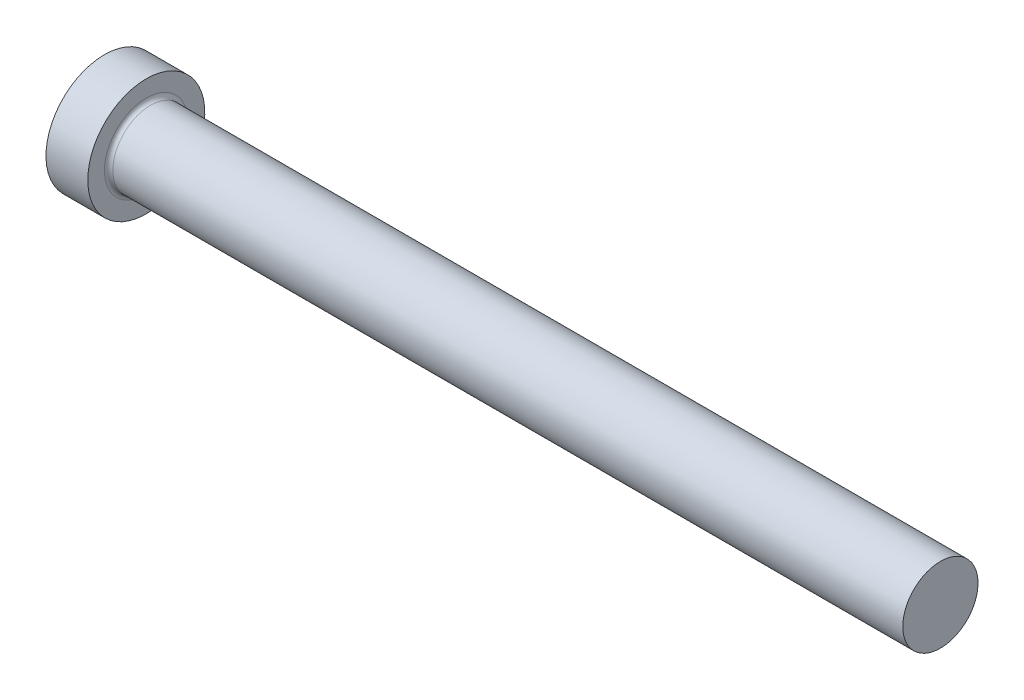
ISO-10303-21;
HEADER;
FILE_DESCRIPTION(('STEP AP214'),'2;1');
FILE_NAME('part.step','',(''),(''),'','','');
FILE_SCHEMA(('AUTOMOTIVE_DESIGN { 1 0 10303 214 1 1 1 1 }'));
ENDSEC;
DATA;
#1=APPLICATION_CONTEXT('core data for automotive mechanical design processes');
#2=APPLICATION_PROTOCOL_DEFINITION('international standard','automotive_design',2000,#1);
#3=PRODUCT_CONTEXT('',#1,'mechanical');
#4=PRODUCT('Part','Part','',(#3));
#5=PRODUCT_RELATED_PRODUCT_CATEGORY('part','',(#4));
#6=PRODUCT_DEFINITION_FORMATION('','',#4);
#7=PRODUCT_DEFINITION_CONTEXT('part definition',#1,'design');
#8=PRODUCT_DEFINITION('design','',#6,#7);
#9=PRODUCT_DEFINITION_SHAPE('','',#8);
#10=(LENGTH_UNIT() NAMED_UNIT(*) SI_UNIT(.MILLI.,.METRE.));
#11=(NAMED_UNIT(*) PLANE_ANGLE_UNIT() SI_UNIT($,.RADIAN.));
#12=(NAMED_UNIT(*) SI_UNIT($,.STERADIAN.) SOLID_ANGLE_UNIT());
#13=UNCERTAINTY_MEASURE_WITH_UNIT(LENGTH_MEASURE(1.E-05),#10,'distance_accuracy_value','');
#14=(GEOMETRIC_REPRESENTATION_CONTEXT(3) GLOBAL_UNCERTAINTY_ASSIGNED_CONTEXT((#13)) GLOBAL_UNIT_ASSIGNED_CONTEXT((#10,
#11,#12)) REPRESENTATION_CONTEXT('',''));
#15=CARTESIAN_POINT('',(0.,0.,0.));
#16=DIRECTION('',(0.,0.,1.));
#17=DIRECTION('',(1.,0.,0.));
#18=AXIS2_PLACEMENT_3D('',#15,#16,#17);
#19=CARTESIAN_POINT('',(0.,0.,0.));
#20=DIRECTION('',(-1.,0.,0.));
#21=DIRECTION('',(0.,-1.,0.));
#22=AXIS2_PLACEMENT_3D('',#19,#20,#21);
#23=PLANE('',#22);
#24=CARTESIAN_POINT('',(0.,0.,0.));
#25=DIRECTION('',(1.,0.,0.));
#26=DIRECTION('',(0.,1.,0.));
#27=AXIS2_PLACEMENT_3D('',#24,#25,#26);
#28=CIRCLE('',#27,7.);
#29=CARTESIAN_POINT('',(0.,7.,0.));
#30=VERTEX_POINT('',#29);
#31=EDGE_CURVE('E24',#30,#30,#28,.T.);
#32=ORIENTED_EDGE('',*,*,#31,.F.);
#33=EDGE_LOOP('',(#32));
#34=FACE_BOUND('',#33,.T.);
#35=ADVANCED_FACE('F13',(#34),#23,.T.);
#36=CARTESIAN_POINT('',(100.,0.,0.));
#37=DIRECTION('',(1.,0.,0.));
#38=DIRECTION('',(0.,1.,0.));
#39=AXIS2_PLACEMENT_3D('',#36,#37,#38);
#40=CYLINDRICAL_SURFACE('',#39,7.);
#41=ORIENTED_EDGE('',*,*,#31,.T.);
#42=EDGE_LOOP('',(#41));
#43=FACE_BOUND('',#42,.T.);
#44=CARTESIAN_POINT('',(5.,0.,0.));
#45=DIRECTION('',(1.,0.,0.));
#46=DIRECTION('',(0.,1.,0.));
#47=AXIS2_PLACEMENT_3D('',#44,#45,#46);
#48=CIRCLE('',#47,7.);
#49=CARTESIAN_POINT('',(5.00000000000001,7.,0.));
#50=VERTEX_POINT('',#49);
#51=EDGE_CURVE('E28',#50,#50,#48,.T.);
#52=ORIENTED_EDGE('',*,*,#51,.F.);
#53=EDGE_LOOP('',(#52));
#54=FACE_BOUND('',#53,.T.);
#55=ADVANCED_FACE('F50',(#43,#54),#40,.T.);
#56=CARTESIAN_POINT('',(5.,7.,0.));
#57=DIRECTION('',(1.,0.,0.));
#58=DIRECTION('',(0.,1.,0.));
#59=AXIS2_PLACEMENT_3D('',#56,#57,#58);
#60=PLANE('',#59);
#61=CARTESIAN_POINT('',(5.,0.,0.));
#62=DIRECTION('',(1.,0.,0.));
#63=DIRECTION('',(0.,1.,0.));
#64=AXIS2_PLACEMENT_3D('',#61,#62,#63);
#65=CIRCLE('',#64,5.);
#66=CARTESIAN_POINT('',(5.,5.,0.));
#67=VERTEX_POINT('',#66);
#68=EDGE_CURVE('E8',#67,#67,#65,.F.);
#69=ORIENTED_EDGE('',*,*,#68,.T.);
#70=EDGE_LOOP('',(#69));
#71=FACE_BOUND('',#70,.T.);
#72=ORIENTED_EDGE('',*,*,#51,.T.);
#73=EDGE_LOOP('',(#72));
#74=FACE_BOUND('',#73,.T.);
#75=ADVANCED_FACE('F41',(#71,#74),#60,.T.);
#76=CARTESIAN_POINT('',(100.,0.,0.));
#77=DIRECTION('',(1.,0.,0.));
#78=DIRECTION('',(0.,1.,0.));
#79=AXIS2_PLACEMENT_3D('',#76,#77,#78);
#80=CYLINDRICAL_SURFACE('',#79,4.49999999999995);
#81=CARTESIAN_POINT('',(5.5,0.,0.));
#82=DIRECTION('',(1.,0.,0.));
#83=DIRECTION('',(0.,1.,0.));
#84=AXIS2_PLACEMENT_3D('',#81,#82,#83);
#85=CIRCLE('',#84,4.49999999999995);
#86=CARTESIAN_POINT('',(5.5,4.49999999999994,0.));
#87=VERTEX_POINT('',#86);
#88=EDGE_CURVE('E20',#87,#87,#85,.T.);
#89=ORIENTED_EDGE('',*,*,#88,.T.);
#90=EDGE_LOOP('',(#89));
#91=FACE_BOUND('',#90,.T.);
#92=CARTESIAN_POINT('',(100.,0.,0.));
#93=DIRECTION('',(1.,0.,0.));
#94=DIRECTION('',(0.,1.,0.));
#95=AXIS2_PLACEMENT_3D('',#92,#93,#94);
#96=CIRCLE('',#95,4.5);
#97=CARTESIAN_POINT('',(100.,4.49999999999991,0.));
#98=VERTEX_POINT('',#97);
#99=EDGE_CURVE('E33',#98,#98,#96,.T.);
#100=ORIENTED_EDGE('',*,*,#99,.F.);
#101=EDGE_LOOP('',(#100));
#102=FACE_BOUND('',#101,.T.);
#103=ADVANCED_FACE('F39',(#91,#102),#80,.T.);
#104=CARTESIAN_POINT('',(100.,4.4999999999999,0.));
#105=DIRECTION('',(1.,0.,0.));
#106=DIRECTION('',(0.,1.,0.));
#107=AXIS2_PLACEMENT_3D('',#104,#105,#106);
#108=PLANE('',#107);
#109=ORIENTED_EDGE('',*,*,#99,.T.);
#110=EDGE_LOOP('',(#109));
#111=FACE_BOUND('',#110,.T.);
#112=ADVANCED_FACE('F37',(#111),#108,.T.);
#113=CARTESIAN_POINT('',(5.5,0.,0.));
#114=DIRECTION('',(1.,0.,0.));
#115=DIRECTION('',(0.,1.,0.));
#116=AXIS2_PLACEMENT_3D('',#113,#114,#115);
#117=TOROIDAL_SURFACE('',#116,5.,0.5);
#118=ORIENTED_EDGE('',*,*,#68,.F.);
#119=EDGE_LOOP('',(#118));
#120=FACE_BOUND('',#119,.T.);
#121=ORIENTED_EDGE('',*,*,#88,.F.);
#122=EDGE_LOOP('',(#121));
#123=FACE_BOUND('',#122,.T.);
#124=ADVANCED_FACE('F15',(#120,#123),#117,.F.);
#125=CLOSED_SHELL('',(#35,#55,#75,#103,#112,#124));
#126=MANIFOLD_SOLID_BREP('B1',#125);
#127=ADVANCED_BREP_SHAPE_REPRESENTATION('',(#18,#126),#14);
#128=SHAPE_DEFINITION_REPRESENTATION(#9,#127);
ENDSEC;
END-ISO-10303-21;
